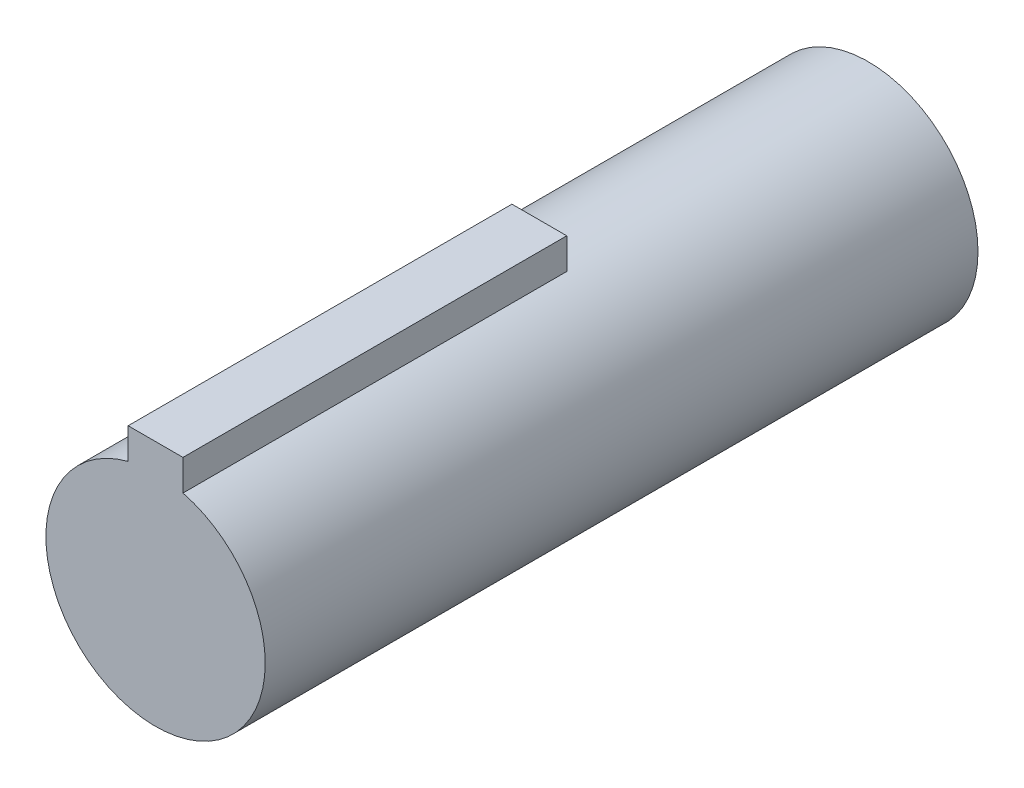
ISO-10303-21;
HEADER;
FILE_DESCRIPTION(('STEP AP214'),'2;1');
FILE_NAME('part.step','',(''),(''),'','','');
FILE_SCHEMA(('AUTOMOTIVE_DESIGN { 1 0 10303 214 1 1 1 1 }'));
ENDSEC;
DATA;
#1=APPLICATION_CONTEXT('core data for automotive mechanical design processes');
#2=APPLICATION_PROTOCOL_DEFINITION('international standard','automotive_design',2000,#1);
#3=PRODUCT_CONTEXT('',#1,'mechanical');
#4=PRODUCT('Part','Part','',(#3));
#5=PRODUCT_RELATED_PRODUCT_CATEGORY('part','',(#4));
#6=PRODUCT_DEFINITION_FORMATION('','',#4);
#7=PRODUCT_DEFINITION_CONTEXT('part definition',#1,'design');
#8=PRODUCT_DEFINITION('design','',#6,#7);
#9=PRODUCT_DEFINITION_SHAPE('','',#8);
#10=(LENGTH_UNIT() NAMED_UNIT(*) SI_UNIT(.MILLI.,.METRE.));
#11=(NAMED_UNIT(*) PLANE_ANGLE_UNIT() SI_UNIT($,.RADIAN.));
#12=(NAMED_UNIT(*) SI_UNIT($,.STERADIAN.) SOLID_ANGLE_UNIT());
#13=UNCERTAINTY_MEASURE_WITH_UNIT(LENGTH_MEASURE(1.E-05),#10,'distance_accuracy_value','');
#14=(GEOMETRIC_REPRESENTATION_CONTEXT(3) GLOBAL_UNCERTAINTY_ASSIGNED_CONTEXT((#13)) GLOBAL_UNIT_ASSIGNED_CONTEXT((#10,
#11,#12)) REPRESENTATION_CONTEXT('',''));
#15=CARTESIAN_POINT('',(0.,0.,0.));
#16=DIRECTION('',(0.,0.,1.));
#17=DIRECTION('',(1.,0.,0.));
#18=AXIS2_PLACEMENT_3D('',#15,#16,#17);
#19=CARTESIAN_POINT('',(5.,24.9999999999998,-120.));
#20=DIRECTION('',(0.,1.,0.));
#21=DIRECTION('',(-1.,0.,0.));
#22=AXIS2_PLACEMENT_3D('',#19,#20,#21);
#23=PLANE('',#22);
#24=DIRECTION('',(0.,0.,1.));
#25=VECTOR('',#24,1.);
#26=CARTESIAN_POINT('',(5.,24.9999999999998,-120.));
#27=LINE('',#26,#25);
#28=CARTESIAN_POINT('',(5.,24.9999999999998,-60.));
#29=VERTEX_POINT('',#28);
#30=CARTESIAN_POINT('',(5.,24.9999999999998,10.));
#31=VERTEX_POINT('',#30);
#32=EDGE_CURVE('E11',#29,#31,#27,.T.);
#33=ORIENTED_EDGE('',*,*,#32,.F.);
#34=DIRECTION('',(1.,0.,0.));
#35=VECTOR('',#34,1.);
#36=CARTESIAN_POINT('',(-4.99999999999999,24.9999999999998,-60.));
#37=LINE('',#36,#35);
#38=CARTESIAN_POINT('',(-4.99999999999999,24.9999999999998,-60.));
#39=VERTEX_POINT('',#38);
#40=EDGE_CURVE('E77',#39,#29,#37,.T.);
#41=ORIENTED_EDGE('',*,*,#40,.F.);
#42=DIRECTION('',(0.,0.,1.));
#43=VECTOR('',#42,1.);
#44=CARTESIAN_POINT('',(-4.99999999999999,24.9999999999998,-120.));
#45=LINE('',#44,#43);
#46=CARTESIAN_POINT('',(-4.99999999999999,24.9999999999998,10.));
#47=VERTEX_POINT('',#46);
#48=EDGE_CURVE('E35',#39,#47,#45,.T.);
#49=ORIENTED_EDGE('',*,*,#48,.T.);
#50=DIRECTION('',(-1.,0.,0.));
#51=VECTOR('',#50,1.);
#52=CARTESIAN_POINT('',(5.,24.9999999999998,10.));
#53=LINE('',#52,#51);
#54=EDGE_CURVE('E105',#31,#47,#53,.T.);
#55=ORIENTED_EDGE('',*,*,#54,.F.);
#56=EDGE_LOOP('',(#33,#41,#49,#55));
#57=FACE_BOUND('',#56,.T.);
#58=ADVANCED_FACE('F32',(#57),#23,.T.);
#59=CARTESIAN_POINT('',(5.00000000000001,19.3649167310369,-120.));
#60=DIRECTION('',(1.,0.,0.));
#61=DIRECTION('',(0.,1.,0.));
#62=AXIS2_PLACEMENT_3D('',#59,#60,#61);
#63=PLANE('',#62);
#64=DIRECTION('',(0.,0.,1.));
#65=VECTOR('',#64,1.);
#66=CARTESIAN_POINT('',(5.00000000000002,19.3649167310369,-120.));
#67=LINE('',#66,#65);
#68=CARTESIAN_POINT('',(5.00000000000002,19.3649167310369,-60.));
#69=VERTEX_POINT('',#68);
#70=CARTESIAN_POINT('',(5.00000000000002,19.3649167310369,10.));
#71=VERTEX_POINT('',#70);
#72=EDGE_CURVE('E40',#69,#71,#67,.T.);
#73=ORIENTED_EDGE('',*,*,#72,.F.);
#74=DIRECTION('',(0.,-1.,0.));
#75=VECTOR('',#74,1.);
#76=CARTESIAN_POINT('',(5.,24.9999999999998,-60.));
#77=LINE('',#76,#75);
#78=EDGE_CURVE('E86',#29,#69,#77,.T.);
#79=ORIENTED_EDGE('',*,*,#78,.F.);
#80=ORIENTED_EDGE('',*,*,#32,.T.);
#81=DIRECTION('',(0.,1.,0.));
#82=VECTOR('',#81,1.);
#83=CARTESIAN_POINT('',(5.00000000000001,19.3649167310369,10.));
#84=LINE('',#83,#82);
#85=EDGE_CURVE('E95',#71,#31,#84,.T.);
#86=ORIENTED_EDGE('',*,*,#85,.F.);
#87=EDGE_LOOP('',(#73,#79,#80,#86));
#88=FACE_BOUND('',#87,.T.);
#89=ADVANCED_FACE('F109',(#88),#63,.T.);
#90=CARTESIAN_POINT('',(-4.99999999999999,24.9999999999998,-120.));
#91=DIRECTION('',(-1.,0.,0.));
#92=DIRECTION('',(0.,0.,1.));
#93=AXIS2_PLACEMENT_3D('',#90,#91,#92);
#94=PLANE('',#93);
#95=ORIENTED_EDGE('',*,*,#48,.F.);
#96=DIRECTION('',(0.,1.,0.));
#97=VECTOR('',#96,1.);
#98=CARTESIAN_POINT('',(-4.99999999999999,19.3649167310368,-60.));
#99=LINE('',#98,#97);
#100=CARTESIAN_POINT('',(-4.99999999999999,19.3649167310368,-60.));
#101=VERTEX_POINT('',#100);
#102=EDGE_CURVE('E74',#101,#39,#99,.T.);
#103=ORIENTED_EDGE('',*,*,#102,.F.);
#104=DIRECTION('',(0.,0.,1.));
#105=VECTOR('',#104,1.);
#106=CARTESIAN_POINT('',(-4.99999999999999,19.3649167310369,-120.));
#107=LINE('',#106,#105);
#108=CARTESIAN_POINT('',(-4.99999999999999,19.3649167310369,10.));
#109=VERTEX_POINT('',#108);
#110=EDGE_CURVE('E92',#101,#109,#107,.T.);
#111=ORIENTED_EDGE('',*,*,#110,.T.);
#112=DIRECTION('',(0.,-1.,0.));
#113=VECTOR('',#112,1.);
#114=CARTESIAN_POINT('',(-4.99999999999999,24.9999999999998,10.));
#115=LINE('',#114,#113);
#116=EDGE_CURVE('E90',#47,#109,#115,.T.);
#117=ORIENTED_EDGE('',*,*,#116,.F.);
#118=EDGE_LOOP('',(#95,#103,#111,#117));
#119=FACE_BOUND('',#118,.T.);
#120=ADVANCED_FACE('F88',(#119),#94,.T.);
#121=CARTESIAN_POINT('',(1.11022266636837E-13,0.,-120.));
#122=DIRECTION('',(0.,0.,1.));
#123=DIRECTION('',(1.,0.,0.));
#124=AXIS2_PLACEMENT_3D('',#121,#122,#123);
#125=CYLINDRICAL_SURFACE('',#124,19.9999999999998);
#126=CARTESIAN_POINT('',(1.11022266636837E-13,0.,-60.));
#127=DIRECTION('',(0.,0.,1.));
#128=DIRECTION('',(-1.,0.,0.));
#129=AXIS2_PLACEMENT_3D('',#126,#127,#128);
#130=CIRCLE('',#129,19.9999999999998);
#131=EDGE_CURVE('E78',#69,#101,#130,.T.);
#132=ORIENTED_EDGE('',*,*,#131,.F.);
#133=ORIENTED_EDGE('',*,*,#72,.T.);
#134=CARTESIAN_POINT('',(1.11022266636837E-13,0.,10.));
#135=DIRECTION('',(0.,0.,1.));
#136=DIRECTION('',(1.,0.,0.));
#137=AXIS2_PLACEMENT_3D('',#134,#135,#136);
#138=CIRCLE('',#137,19.9999999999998);
#139=EDGE_CURVE('E99',#109,#71,#138,.T.);
#140=ORIENTED_EDGE('',*,*,#139,.F.);
#141=ORIENTED_EDGE('',*,*,#110,.F.);
#142=EDGE_LOOP('',(#132,#133,#140,#141));
#143=FACE_BOUND('',#142,.T.);
#144=CARTESIAN_POINT('',(1.11022266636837E-13,0.,-120.));
#145=DIRECTION('',(0.,0.,1.));
#146=DIRECTION('',(1.,0.,0.));
#147=AXIS2_PLACEMENT_3D('',#144,#145,#146);
#148=CIRCLE('',#147,19.9999999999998);
#149=CARTESIAN_POINT('',(19.9999999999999,0.,-120.));
#150=VERTEX_POINT('',#149);
#151=EDGE_CURVE('E93',#150,#150,#148,.T.);
#152=ORIENTED_EDGE('',*,*,#151,.T.);
#153=EDGE_LOOP('',(#152));
#154=FACE_BOUND('',#153,.T.);
#155=ADVANCED_FACE('F108',(#143,#154),#125,.T.);
#156=CARTESIAN_POINT('',(1.11022266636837E-13,0.,-120.));
#157=DIRECTION('',(0.,0.,1.));
#158=DIRECTION('',(1.,0.,0.));
#159=AXIS2_PLACEMENT_3D('',#156,#157,#158);
#160=PLANE('',#159);
#161=ORIENTED_EDGE('',*,*,#151,.F.);
#162=EDGE_LOOP('',(#161));
#163=FACE_BOUND('',#162,.T.);
#164=ADVANCED_FACE('F113',(#163),#160,.F.);
#165=CARTESIAN_POINT('',(1.11022266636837E-13,0.,10.));
#166=DIRECTION('',(0.,0.,1.));
#167=DIRECTION('',(1.,0.,0.));
#168=AXIS2_PLACEMENT_3D('',#165,#166,#167);
#169=PLANE('',#168);
#170=ORIENTED_EDGE('',*,*,#54,.T.);
#171=ORIENTED_EDGE('',*,*,#116,.T.);
#172=ORIENTED_EDGE('',*,*,#139,.T.);
#173=ORIENTED_EDGE('',*,*,#85,.T.);
#174=EDGE_LOOP('',(#170,#171,#172,#173));
#175=FACE_BOUND('',#174,.T.);
#176=ADVANCED_FACE('F111',(#175),#169,.T.);
#177=CARTESIAN_POINT('',(1.11022266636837E-13,0.,-60.));
#178=DIRECTION('',(0.,0.,-1.));
#179=DIRECTION('',(-1.,0.,0.));
#180=AXIS2_PLACEMENT_3D('',#177,#178,#179);
#181=PLANE('',#180);
#182=ORIENTED_EDGE('',*,*,#102,.T.);
#183=ORIENTED_EDGE('',*,*,#40,.T.);
#184=ORIENTED_EDGE('',*,*,#78,.T.);
#185=ORIENTED_EDGE('',*,*,#131,.T.);
#186=EDGE_LOOP('',(#182,#183,#184,#185));
#187=FACE_BOUND('',#186,.T.);
#188=ADVANCED_FACE('F76',(#187),#181,.T.);
#189=CLOSED_SHELL('',(#58,#89,#120,#155,#164,#176,#188));
#190=MANIFOLD_SOLID_BREP('B2',#189);
#191=ADVANCED_BREP_SHAPE_REPRESENTATION('',(#18,#190),#14);
#192=SHAPE_DEFINITION_REPRESENTATION(#9,#191);
ENDSEC;
END-ISO-10303-21;
